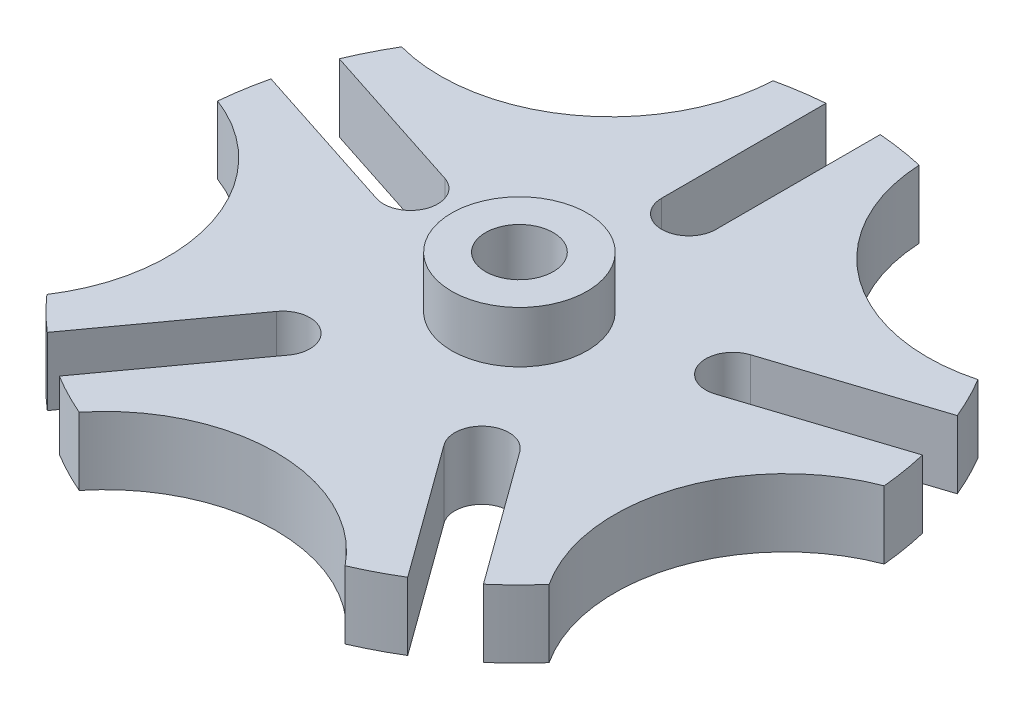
ISO-10303-21;
HEADER;
FILE_DESCRIPTION(('STEP AP214'),'2;1');
FILE_NAME('part.step','',(''),(''),'','','');
FILE_SCHEMA(('AUTOMOTIVE_DESIGN { 1 0 10303 214 1 1 1 1 }'));
ENDSEC;
DATA;
#1=APPLICATION_CONTEXT('core data for automotive mechanical design processes');
#2=APPLICATION_PROTOCOL_DEFINITION('international standard','automotive_design',2000,#1);
#3=PRODUCT_CONTEXT('',#1,'mechanical');
#4=PRODUCT('Part','Part','',(#3));
#5=PRODUCT_RELATED_PRODUCT_CATEGORY('part','',(#4));
#6=PRODUCT_DEFINITION_FORMATION('','',#4);
#7=PRODUCT_DEFINITION_CONTEXT('part definition',#1,'design');
#8=PRODUCT_DEFINITION('design','',#6,#7);
#9=PRODUCT_DEFINITION_SHAPE('','',#8);
#10=(LENGTH_UNIT() NAMED_UNIT(*) SI_UNIT(.MILLI.,.METRE.));
#11=(NAMED_UNIT(*) PLANE_ANGLE_UNIT() SI_UNIT($,.RADIAN.));
#12=(NAMED_UNIT(*) SI_UNIT($,.STERADIAN.) SOLID_ANGLE_UNIT());
#13=UNCERTAINTY_MEASURE_WITH_UNIT(LENGTH_MEASURE(1.E-05),#10,'distance_accuracy_value','');
#14=(GEOMETRIC_REPRESENTATION_CONTEXT(3) GLOBAL_UNCERTAINTY_ASSIGNED_CONTEXT((#13)) GLOBAL_UNIT_ASSIGNED_CONTEXT((#10,
#11,#12)) REPRESENTATION_CONTEXT('',''));
#15=CARTESIAN_POINT('',(0.,0.,0.));
#16=DIRECTION('',(0.,0.,1.));
#17=DIRECTION('',(1.,0.,0.));
#18=AXIS2_PLACEMENT_3D('',#15,#16,#17);
#19=CARTESIAN_POINT('',(0.,3.175,0.));
#20=DIRECTION('',(0.,1.,0.));
#21=DIRECTION('',(0.,0.,1.));
#22=AXIS2_PLACEMENT_3D('',#19,#20,#21);
#23=PLANE('',#22);
#24=CARTESIAN_POINT('',(-22.823101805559,3.175,-31.4133046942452));
#25=DIRECTION('',(0.,1.,0.));
#26=DIRECTION('',(0.95105651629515,0.,0.309016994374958));
#27=AXIS2_PLACEMENT_3D('',#24,#25,#26);
#28=CIRCLE('',#27,16.002);
#29=CARTESIAN_POINT('',(-27.0015845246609,3.175,-15.9664834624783));
#30=VERTEX_POINT('',#29);
#31=CARTESIAN_POINT('',(-6.84107964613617,3.175,-30.6139476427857));
#32=VERTEX_POINT('',#31);
#33=EDGE_CURVE('E229',#30,#32,#28,.T.);
#34=ORIENTED_EDGE('',*,*,#33,.F.);
#35=CARTESIAN_POINT('',(0.,3.175,0.));
#36=DIRECTION('',(0.,1.,0.));
#37=DIRECTION('',(0.,0.,1.));
#38=AXIS2_PLACEMENT_3D('',#35,#36,#37);
#39=CIRCLE('',#38,31.369);
#40=CARTESIAN_POINT('',(-28.9508269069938,3.175,-12.0774079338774));
#41=VERTEX_POINT('',#40);
#42=EDGE_CURVE('E41',#30,#41,#39,.T.);
#43=ORIENTED_EDGE('',*,*,#42,.T.);
#44=DIRECTION('',(-0.95105651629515,0.,-0.309016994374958));
#45=VECTOR('',#44,1.);
#46=CARTESIAN_POINT('',(-14.3131190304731,3.175,-7.32132833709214));
#47=LINE('',#46,#45);
#48=CARTESIAN_POINT('',(-14.3131190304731,3.175,-7.32132833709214));
#49=VERTEX_POINT('',#48);
#50=EDGE_CURVE('E356',#49,#41,#47,.T.);
#51=ORIENTED_EDGE('',*,*,#50,.F.);
#52=CARTESIAN_POINT('',(-15.0980221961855,3.175,-4.90564478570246));
#53=DIRECTION('',(0.,1.,0.));
#54=DIRECTION('',(-0.95105651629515,0.,-0.309016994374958));
#55=AXIS2_PLACEMENT_3D('',#52,#53,#54);
#56=CIRCLE('',#55,2.54);
#57=CARTESIAN_POINT('',(-15.8829253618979,3.175,-2.48996123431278));
#58=VERTEX_POINT('',#57);
#59=EDGE_CURVE('E368',#58,#49,#56,.T.);
#60=ORIENTED_EDGE('',*,*,#59,.F.);
#61=DIRECTION('',(0.95105651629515,0.,0.309016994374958));
#62=VECTOR('',#61,1.);
#63=CARTESIAN_POINT('',(-15.8829253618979,3.175,-2.48996123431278));
#64=LINE('',#63,#62);
#65=CARTESIAN_POINT('',(-30.5206332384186,3.175,-7.24604083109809));
#66=VERTEX_POINT('',#65);
#67=EDGE_CURVE('E375',#66,#58,#64,.T.);
#68=ORIENTED_EDGE('',*,*,#67,.F.);
#69=CARTESIAN_POINT('',(-31.2296042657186,3.175,-2.9539767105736));
#70=VERTEX_POINT('',#69);
#71=EDGE_CURVE('E282',#66,#70,#39,.T.);
#72=ORIENTED_EDGE('',*,*,#71,.T.);
#73=CARTESIAN_POINT('',(-36.9285544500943,3.175,11.9988146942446));
#74=DIRECTION('',(0.,1.,0.));
#75=DIRECTION('',(0.58778525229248,0.,-0.809016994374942));
#76=AXIS2_PLACEMENT_3D('',#73,#74,#75);
#77=CIRCLE('',#76,16.002);
#78=CARTESIAN_POINT('',(-23.5289766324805,3.175,20.7461181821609));
#79=VERTEX_POINT('',#78);
#80=EDGE_CURVE('E327',#79,#70,#77,.T.);
#81=ORIENTED_EDGE('',*,*,#80,.F.);
#82=CARTESIAN_POINT('',(-20.4325950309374,3.175,23.8017482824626));
#83=VERTEX_POINT('',#82);
#84=EDGE_CURVE('E514',#79,#83,#39,.T.);
#85=ORIENTED_EDGE('',*,*,#84,.T.);
#86=DIRECTION('',(-0.58778525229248,0.,0.809016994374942));
#87=VECTOR('',#86,1.);
#88=CARTESIAN_POINT('',(-11.3859940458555,3.175,11.3501702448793));
#89=LINE('',#88,#87);
#90=CARTESIAN_POINT('',(-11.3859940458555,3.175,11.3501702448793));
#91=VERTEX_POINT('',#90);
#92=EDGE_CURVE('E380',#91,#83,#89,.T.);
#93=ORIENTED_EDGE('',*,*,#92,.F.);
#94=CARTESIAN_POINT('',(-9.33109088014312,3.175,12.8431447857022));
#95=DIRECTION('',(0.,1.,0.));
#96=DIRECTION('',(-0.58778525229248,0.,0.809016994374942));
#97=AXIS2_PLACEMENT_3D('',#94,#95,#96);
#98=CIRCLE('',#97,2.54);
#99=CARTESIAN_POINT('',(-7.27618771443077,3.175,14.3361193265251));
#100=VERTEX_POINT('',#99);
#101=EDGE_CURVE('E390',#100,#91,#98,.T.);
#102=ORIENTED_EDGE('',*,*,#101,.F.);
#103=DIRECTION('',(0.58778525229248,0.,-0.809016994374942));
#104=VECTOR('',#103,1.);
#105=CARTESIAN_POINT('',(-7.27618771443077,3.175,14.3361193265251));
#106=LINE('',#105,#104);
#107=CARTESIAN_POINT('',(-16.3227886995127,3.175,26.7876973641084));
#108=VERTEX_POINT('',#107);
#109=EDGE_CURVE('E398',#108,#100,#106,.T.);
#110=ORIENTED_EDGE('',*,*,#109,.F.);
#111=CARTESIAN_POINT('',(-12.4598772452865,3.175,28.7882896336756));
#112=VERTEX_POINT('',#111);
#113=EDGE_CURVE('E519',#108,#112,#39,.T.);
#114=ORIENTED_EDGE('',*,*,#113,.T.);
#115=CARTESIAN_POINT('',(-2.84494650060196E-13,3.175,38.82898));
#116=DIRECTION('',(0.,1.,0.));
#117=DIRECTION('',(-0.587785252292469,0.,-0.809016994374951));
#118=AXIS2_PLACEMENT_3D('',#115,#116,#117);
#119=CIRCLE('',#118,16.002);
#120=CARTESIAN_POINT('',(12.459877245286,3.175,28.7882896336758));
#121=VERTEX_POINT('',#120);
#122=EDGE_CURVE('E325',#121,#112,#119,.T.);
#123=ORIENTED_EDGE('',*,*,#122,.F.);
#124=CARTESIAN_POINT('',(16.3227886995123,3.175,26.7876973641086));
#125=VERTEX_POINT('',#124);
#126=EDGE_CURVE('E520',#121,#125,#39,.T.);
#127=ORIENTED_EDGE('',*,*,#126,.T.);
#128=DIRECTION('',(0.587785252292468,0.,0.809016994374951));
#129=VECTOR('',#128,1.);
#130=CARTESIAN_POINT('',(7.27618771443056,3.175,14.3361193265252));
#131=LINE('',#130,#129);
#132=CARTESIAN_POINT('',(7.27618771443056,3.175,14.3361193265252));
#133=VERTEX_POINT('',#132);
#134=EDGE_CURVE('E406',#133,#125,#131,.T.);
#135=ORIENTED_EDGE('',*,*,#134,.F.);
#136=CARTESIAN_POINT('',(9.33109088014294,3.175,12.8431447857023));
#137=DIRECTION('',(0.,1.,0.));
#138=DIRECTION('',(0.587785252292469,0.,0.809016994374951));
#139=AXIS2_PLACEMENT_3D('',#136,#137,#138);
#140=CIRCLE('',#139,2.54);
#141=CARTESIAN_POINT('',(11.3859940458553,3.175,11.3501702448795));
#142=VERTEX_POINT('',#141);
#143=EDGE_CURVE('E417',#142,#133,#140,.T.);
#144=ORIENTED_EDGE('',*,*,#143,.F.);
#145=DIRECTION('',(-0.587785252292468,0.,-0.809016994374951));
#146=VECTOR('',#145,1.);
#147=CARTESIAN_POINT('',(11.3859940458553,3.175,11.3501702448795));
#148=LINE('',#147,#146);
#149=CARTESIAN_POINT('',(20.4325950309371,3.175,23.8017482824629));
#150=VERTEX_POINT('',#149);
#151=EDGE_CURVE('E425',#150,#142,#148,.T.);
#152=ORIENTED_EDGE('',*,*,#151,.F.);
#153=CARTESIAN_POINT('',(23.5289766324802,3.175,20.7461181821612));
#154=VERTEX_POINT('',#153);
#155=EDGE_CURVE('E522',#150,#154,#39,.T.);
#156=ORIENTED_EDGE('',*,*,#155,.T.);
#157=CARTESIAN_POINT('',(36.9285544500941,3.175,11.9988146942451));
#158=DIRECTION('',(0.,1.,0.));
#159=DIRECTION('',(-0.951056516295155,0.,0.309016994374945));
#160=AXIS2_PLACEMENT_3D('',#157,#158,#159);
#161=CIRCLE('',#160,16.002);
#162=CARTESIAN_POINT('',(31.2296042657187,3.175,-2.95397671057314));
#163=VERTEX_POINT('',#162);
#164=EDGE_CURVE('E339',#163,#154,#161,.T.);
#165=ORIENTED_EDGE('',*,*,#164,.F.);
#166=CARTESIAN_POINT('',(30.5206332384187,3.175,-7.24604083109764));
#167=VERTEX_POINT('',#166);
#168=EDGE_CURVE('E283',#163,#167,#39,.T.);
#169=ORIENTED_EDGE('',*,*,#168,.T.);
#170=DIRECTION('',(0.951056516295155,0.,-0.309016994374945));
#171=VECTOR('',#170,1.);
#172=CARTESIAN_POINT('',(15.8829253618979,3.175,-2.48996123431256));
#173=LINE('',#172,#171);
#174=CARTESIAN_POINT('',(15.8829253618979,3.175,-2.48996123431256));
#175=VERTEX_POINT('',#174);
#176=EDGE_CURVE('E433',#175,#167,#173,.T.);
#177=ORIENTED_EDGE('',*,*,#176,.F.);
#178=CARTESIAN_POINT('',(15.0980221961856,3.175,-4.90564478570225));
#179=DIRECTION('',(0.,1.,0.));
#180=DIRECTION('',(0.951056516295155,0.,-0.309016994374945));
#181=AXIS2_PLACEMENT_3D('',#178,#179,#180);
#182=CIRCLE('',#181,2.54);
#183=CARTESIAN_POINT('',(14.3131190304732,3.175,-7.32132833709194));
#184=VERTEX_POINT('',#183);
#185=EDGE_CURVE('E444',#184,#175,#182,.T.);
#186=ORIENTED_EDGE('',*,*,#185,.F.);
#187=DIRECTION('',(-0.951056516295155,0.,0.309016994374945));
#188=VECTOR('',#187,1.);
#189=CARTESIAN_POINT('',(14.3131190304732,3.175,-7.32132833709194));
#190=LINE('',#189,#188);
#191=CARTESIAN_POINT('',(28.9508269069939,3.175,-12.077407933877));
#192=VERTEX_POINT('',#191);
#193=EDGE_CURVE('E452',#192,#184,#190,.T.);
#194=ORIENTED_EDGE('',*,*,#193,.F.);
#195=CARTESIAN_POINT('',(27.0015845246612,3.175,-15.9664834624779));
#196=VERTEX_POINT('',#195);
#197=EDGE_CURVE('E42',#192,#196,#39,.T.);
#198=ORIENTED_EDGE('',*,*,#197,.T.);
#199=CARTESIAN_POINT('',(22.8231018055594,3.175,-31.4133046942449));
#200=DIRECTION('',(0.,1.,0.));
#201=DIRECTION('',(0.,0.,1.));
#202=AXIS2_PLACEMENT_3D('',#199,#200,#201);
#203=CIRCLE('',#202,16.002);
#204=CARTESIAN_POINT('',(6.84107964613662,3.175,-30.6139476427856));
#205=VERTEX_POINT('',#204);
#206=EDGE_CURVE('E348',#205,#196,#203,.T.);
#207=ORIENTED_EDGE('',*,*,#206,.F.);
#208=CARTESIAN_POINT('',(2.54,3.175,-31.2659968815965));
#209=VERTEX_POINT('',#208);
#210=EDGE_CURVE('E279',#205,#209,#39,.T.);
#211=ORIENTED_EDGE('',*,*,#210,.T.);
#212=DIRECTION('',(0.,0.,-1.));
#213=VECTOR('',#212,1.);
#214=CARTESIAN_POINT('',(2.54,3.175,-15.875));
#215=LINE('',#214,#213);
#216=CARTESIAN_POINT('',(2.54,3.175,-15.875));
#217=VERTEX_POINT('',#216);
#218=EDGE_CURVE('E256',#217,#209,#215,.T.);
#219=ORIENTED_EDGE('',*,*,#218,.F.);
#220=CARTESIAN_POINT('',(0.,3.175,-15.875));
#221=DIRECTION('',(0.,1.,0.));
#222=DIRECTION('',(0.,0.,-1.));
#223=AXIS2_PLACEMENT_3D('',#220,#221,#222);
#224=CIRCLE('',#223,2.54);
#225=CARTESIAN_POINT('',(-2.54,3.175,-15.875));
#226=VERTEX_POINT('',#225);
#227=EDGE_CURVE('E253',#226,#217,#224,.T.);
#228=ORIENTED_EDGE('',*,*,#227,.F.);
#229=DIRECTION('',(0.,0.,1.));
#230=VECTOR('',#229,1.);
#231=CARTESIAN_POINT('',(-2.54,3.175,-15.875));
#232=LINE('',#231,#230);
#233=CARTESIAN_POINT('',(-2.53999999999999,3.175,-31.2659968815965));
#234=VERTEX_POINT('',#233);
#235=EDGE_CURVE('E250',#234,#226,#232,.T.);
#236=ORIENTED_EDGE('',*,*,#235,.F.);
#237=EDGE_CURVE('E11',#234,#32,#39,.T.);
#238=ORIENTED_EDGE('',*,*,#237,.T.);
#239=EDGE_LOOP('',(#34,#43,#51,#60,#68,#72,#81,#85,#93,#102,#110,#114,#123,#127,#135,#144,#152,
#156,#165,#169,#177,#186,#194,#198,#207,#211,#219,#228,#236,#238));
#240=FACE_BOUND('',#239,.T.);
#241=CARTESIAN_POINT('',(0.,3.175,0.));
#242=DIRECTION('',(0.,1.,0.));
#243=DIRECTION('',(0.,0.,1.));
#244=AXIS2_PLACEMENT_3D('',#241,#242,#243);
#245=CIRCLE('',#244,6.35);
#246=CARTESIAN_POINT('',(0.,3.175,6.35));
#247=VERTEX_POINT('',#246);
#248=EDGE_CURVE('E502',#247,#247,#245,.T.);
#249=ORIENTED_EDGE('',*,*,#248,.F.);
#250=EDGE_LOOP('',(#249));
#251=FACE_BOUND('',#250,.T.);
#252=ADVANCED_FACE('F33',(#240,#251),#23,.T.);
#253=CARTESIAN_POINT('',(0.,3.175,0.));
#254=DIRECTION('',(0.,-1.,0.));
#255=DIRECTION('',(0.,0.,-1.));
#256=AXIS2_PLACEMENT_3D('',#253,#254,#255);
#257=CYLINDRICAL_SURFACE('',#256,31.369);
#258=CARTESIAN_POINT('',(0.,-3.175,0.));
#259=DIRECTION('',(0.,1.,0.));
#260=DIRECTION('',(0.,0.,1.));
#261=AXIS2_PLACEMENT_3D('',#258,#259,#260);
#262=CIRCLE('',#261,31.369);
#263=CARTESIAN_POINT('',(-2.53999999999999,-3.175,-31.2659968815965));
#264=VERTEX_POINT('',#263);
#265=CARTESIAN_POINT('',(-6.84107964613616,-3.175,-30.6139476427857));
#266=VERTEX_POINT('',#265);
#267=EDGE_CURVE('E243',#264,#266,#262,.T.);
#268=ORIENTED_EDGE('',*,*,#267,.T.);
#269=DIRECTION('',(0.,1.,0.));
#270=VECTOR('',#269,1.);
#271=CARTESIAN_POINT('',(-6.84107964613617,-3.175,-30.6139476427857));
#272=LINE('',#271,#270);
#273=EDGE_CURVE('E49',#266,#32,#272,.T.);
#274=ORIENTED_EDGE('',*,*,#273,.T.);
#275=ORIENTED_EDGE('',*,*,#237,.F.);
#276=DIRECTION('',(0.,1.,0.));
#277=VECTOR('',#276,1.);
#278=CARTESIAN_POINT('',(-2.53999999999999,-3.175,-31.2659968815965));
#279=LINE('',#278,#277);
#280=EDGE_CURVE('E274',#264,#234,#279,.T.);
#281=ORIENTED_EDGE('',*,*,#280,.F.);
#282=EDGE_LOOP('',(#268,#274,#275,#281));
#283=FACE_BOUND('',#282,.T.);
#284=ADVANCED_FACE('F240',(#283),#257,.T.);
#285=CARTESIAN_POINT('',(-30.5206332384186,-3.175,-7.24604083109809));
#286=VERTEX_POINT('',#285);
#287=CARTESIAN_POINT('',(-31.2296042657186,-3.175,-2.9539767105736));
#288=VERTEX_POINT('',#287);
#289=EDGE_CURVE('E284',#286,#288,#262,.T.);
#290=ORIENTED_EDGE('',*,*,#289,.T.);
#291=DIRECTION('',(0.,1.,0.));
#292=VECTOR('',#291,1.);
#293=CARTESIAN_POINT('',(-31.2296042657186,-3.175,-2.9539767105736));
#294=LINE('',#293,#292);
#295=EDGE_CURVE('E57',#288,#70,#294,.T.);
#296=ORIENTED_EDGE('',*,*,#295,.T.);
#297=ORIENTED_EDGE('',*,*,#71,.F.);
#298=DIRECTION('',(0.,1.,0.));
#299=VECTOR('',#298,1.);
#300=CARTESIAN_POINT('',(-30.5206332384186,-3.175,-7.24604083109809));
#301=LINE('',#300,#299);
#302=EDGE_CURVE('E312',#286,#66,#301,.T.);
#303=ORIENTED_EDGE('',*,*,#302,.F.);
#304=EDGE_LOOP('',(#290,#296,#297,#303));
#305=FACE_BOUND('',#304,.T.);
#306=ADVANCED_FACE('F309',(#305),#257,.T.);
#307=CARTESIAN_POINT('',(-16.3227886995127,-3.175,26.7876973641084));
#308=VERTEX_POINT('',#307);
#309=CARTESIAN_POINT('',(-12.4598772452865,-3.175,28.7882896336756));
#310=VERTEX_POINT('',#309);
#311=EDGE_CURVE('E295',#308,#310,#262,.T.);
#312=ORIENTED_EDGE('',*,*,#311,.T.);
#313=DIRECTION('',(0.,1.,0.));
#314=VECTOR('',#313,1.);
#315=CARTESIAN_POINT('',(-12.4598772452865,-3.175,28.7882896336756));
#316=LINE('',#315,#314);
#317=EDGE_CURVE('E332',#310,#112,#316,.T.);
#318=ORIENTED_EDGE('',*,*,#317,.T.);
#319=ORIENTED_EDGE('',*,*,#113,.F.);
#320=DIRECTION('',(0.,1.,0.));
#321=VECTOR('',#320,1.);
#322=CARTESIAN_POINT('',(-16.3227886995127,-3.175,26.7876973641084));
#323=LINE('',#322,#321);
#324=EDGE_CURVE('E404',#308,#108,#323,.T.);
#325=ORIENTED_EDGE('',*,*,#324,.F.);
#326=EDGE_LOOP('',(#312,#318,#319,#325));
#327=FACE_BOUND('',#326,.T.);
#328=ADVANCED_FACE('F655',(#327),#257,.T.);
#329=CARTESIAN_POINT('',(20.4325950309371,-3.175,23.8017482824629));
#330=VERTEX_POINT('',#329);
#331=CARTESIAN_POINT('',(23.5289766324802,-3.175,20.7461181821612));
#332=VERTEX_POINT('',#331);
#333=EDGE_CURVE('E288',#330,#332,#262,.T.);
#334=ORIENTED_EDGE('',*,*,#333,.T.);
#335=DIRECTION('',(0.,1.,0.));
#336=VECTOR('',#335,1.);
#337=CARTESIAN_POINT('',(23.5289766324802,-3.175,20.7461181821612));
#338=LINE('',#337,#336);
#339=EDGE_CURVE('E341',#332,#154,#338,.T.);
#340=ORIENTED_EDGE('',*,*,#339,.T.);
#341=ORIENTED_EDGE('',*,*,#155,.F.);
#342=DIRECTION('',(0.,1.,0.));
#343=VECTOR('',#342,1.);
#344=CARTESIAN_POINT('',(20.4325950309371,-3.175,23.8017482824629));
#345=LINE('',#344,#343);
#346=EDGE_CURVE('E431',#330,#150,#345,.T.);
#347=ORIENTED_EDGE('',*,*,#346,.F.);
#348=EDGE_LOOP('',(#334,#340,#341,#347));
#349=FACE_BOUND('',#348,.T.);
#350=ADVANCED_FACE('F650',(#349),#257,.T.);
#351=CARTESIAN_POINT('',(28.9508269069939,-3.175,-12.077407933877));
#352=VERTEX_POINT('',#351);
#353=CARTESIAN_POINT('',(27.0015845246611,-3.175,-15.9664834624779));
#354=VERTEX_POINT('',#353);
#355=EDGE_CURVE('E281',#352,#354,#262,.T.);
#356=ORIENTED_EDGE('',*,*,#355,.T.);
#357=DIRECTION('',(0.,1.,0.));
#358=VECTOR('',#357,1.);
#359=CARTESIAN_POINT('',(27.0015845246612,-3.175,-15.9664834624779));
#360=LINE('',#359,#358);
#361=EDGE_CURVE('E354',#354,#196,#360,.T.);
#362=ORIENTED_EDGE('',*,*,#361,.T.);
#363=ORIENTED_EDGE('',*,*,#197,.F.);
#364=DIRECTION('',(0.,1.,0.));
#365=VECTOR('',#364,1.);
#366=CARTESIAN_POINT('',(28.9508269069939,-3.175,-12.077407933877));
#367=LINE('',#366,#365);
#368=EDGE_CURVE('E458',#352,#192,#367,.T.);
#369=ORIENTED_EDGE('',*,*,#368,.F.);
#370=EDGE_LOOP('',(#356,#362,#363,#369));
#371=FACE_BOUND('',#370,.T.);
#372=ADVANCED_FACE('F644',(#371),#257,.T.);
#373=ORIENTED_EDGE('',*,*,#84,.F.);
#374=DIRECTION('',(0.,1.,0.));
#375=VECTOR('',#374,1.);
#376=CARTESIAN_POINT('',(-23.5289766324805,-3.175,20.7461181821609));
#377=LINE('',#376,#375);
#378=CARTESIAN_POINT('',(-23.5289766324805,-3.175,20.7461181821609));
#379=VERTEX_POINT('',#378);
#380=EDGE_CURVE('E323',#379,#79,#377,.T.);
#381=ORIENTED_EDGE('',*,*,#380,.F.);
#382=CARTESIAN_POINT('',(-20.4325950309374,-3.175,23.8017482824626));
#383=VERTEX_POINT('',#382);
#384=EDGE_CURVE('E285',#379,#383,#262,.T.);
#385=ORIENTED_EDGE('',*,*,#384,.T.);
#386=DIRECTION('',(0.,1.,0.));
#387=VECTOR('',#386,1.);
#388=CARTESIAN_POINT('',(-20.4325950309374,-3.175,23.8017482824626));
#389=LINE('',#388,#387);
#390=EDGE_CURVE('E383',#383,#83,#389,.T.);
#391=ORIENTED_EDGE('',*,*,#390,.T.);
#392=EDGE_LOOP('',(#373,#381,#385,#391));
#393=FACE_BOUND('',#392,.T.);
#394=ADVANCED_FACE('F517',(#393),#257,.T.);
#395=ORIENTED_EDGE('',*,*,#126,.F.);
#396=DIRECTION('',(0.,1.,0.));
#397=VECTOR('',#396,1.);
#398=CARTESIAN_POINT('',(12.459877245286,-3.175,28.7882896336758));
#399=LINE('',#398,#397);
#400=CARTESIAN_POINT('',(12.459877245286,-3.175,28.7882896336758));
#401=VERTEX_POINT('',#400);
#402=EDGE_CURVE('E337',#401,#121,#399,.T.);
#403=ORIENTED_EDGE('',*,*,#402,.F.);
#404=CARTESIAN_POINT('',(16.3227886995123,-3.175,26.7876973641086));
#405=VERTEX_POINT('',#404);
#406=EDGE_CURVE('E293',#401,#405,#262,.T.);
#407=ORIENTED_EDGE('',*,*,#406,.T.);
#408=DIRECTION('',(0.,1.,0.));
#409=VECTOR('',#408,1.);
#410=CARTESIAN_POINT('',(16.3227886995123,-3.175,26.7876973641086));
#411=LINE('',#410,#409);
#412=EDGE_CURVE('E409',#405,#125,#411,.T.);
#413=ORIENTED_EDGE('',*,*,#412,.T.);
#414=EDGE_LOOP('',(#395,#403,#407,#413));
#415=FACE_BOUND('',#414,.T.);
#416=ADVANCED_FACE('F626',(#415),#257,.T.);
#417=ORIENTED_EDGE('',*,*,#168,.F.);
#418=DIRECTION('',(0.,1.,0.));
#419=VECTOR('',#418,1.);
#420=CARTESIAN_POINT('',(31.2296042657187,-3.175,-2.95397671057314));
#421=LINE('',#420,#419);
#422=CARTESIAN_POINT('',(31.2296042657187,-3.175,-2.95397671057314));
#423=VERTEX_POINT('',#422);
#424=EDGE_CURVE('E346',#423,#163,#421,.T.);
#425=ORIENTED_EDGE('',*,*,#424,.F.);
#426=CARTESIAN_POINT('',(30.5206332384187,-3.175,-7.24604083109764));
#427=VERTEX_POINT('',#426);
#428=EDGE_CURVE('E287',#423,#427,#262,.T.);
#429=ORIENTED_EDGE('',*,*,#428,.T.);
#430=DIRECTION('',(0.,1.,0.));
#431=VECTOR('',#430,1.);
#432=CARTESIAN_POINT('',(30.5206332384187,-3.175,-7.24604083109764));
#433=LINE('',#432,#431);
#434=EDGE_CURVE('E436',#427,#167,#433,.T.);
#435=ORIENTED_EDGE('',*,*,#434,.T.);
#436=EDGE_LOOP('',(#417,#425,#429,#435));
#437=FACE_BOUND('',#436,.T.);
#438=ADVANCED_FACE('F621',(#437),#257,.T.);
#439=ORIENTED_EDGE('',*,*,#210,.F.);
#440=DIRECTION('',(0.,1.,0.));
#441=VECTOR('',#440,1.);
#442=CARTESIAN_POINT('',(6.84107964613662,-3.175,-30.6139476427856));
#443=LINE('',#442,#441);
#444=CARTESIAN_POINT('',(6.84107964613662,-3.175,-30.6139476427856));
#445=VERTEX_POINT('',#444);
#446=EDGE_CURVE('E353',#445,#205,#443,.T.);
#447=ORIENTED_EDGE('',*,*,#446,.F.);
#448=CARTESIAN_POINT('',(2.54,-3.175,-31.2659968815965));
#449=VERTEX_POINT('',#448);
#450=EDGE_CURVE('E273',#445,#449,#262,.T.);
#451=ORIENTED_EDGE('',*,*,#450,.T.);
#452=DIRECTION('',(0.,1.,0.));
#453=VECTOR('',#452,1.);
#454=CARTESIAN_POINT('',(2.54,-3.175,-31.2659968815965));
#455=LINE('',#454,#453);
#456=EDGE_CURVE('E276',#449,#209,#455,.T.);
#457=ORIENTED_EDGE('',*,*,#456,.T.);
#458=EDGE_LOOP('',(#439,#447,#451,#457));
#459=FACE_BOUND('',#458,.T.);
#460=ADVANCED_FACE('F469',(#459),#257,.T.);
#461=ORIENTED_EDGE('',*,*,#42,.F.);
#462=DIRECTION('',(0.,1.,0.));
#463=VECTOR('',#462,1.);
#464=CARTESIAN_POINT('',(-27.0015845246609,-3.175,-15.9664834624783));
#465=LINE('',#464,#463);
#466=CARTESIAN_POINT('',(-27.0015845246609,-3.175,-15.9664834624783));
#467=VERTEX_POINT('',#466);
#468=EDGE_CURVE('E232',#467,#30,#465,.T.);
#469=ORIENTED_EDGE('',*,*,#468,.F.);
#470=CARTESIAN_POINT('',(-28.9508269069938,-3.175,-12.0774079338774));
#471=VERTEX_POINT('',#470);
#472=EDGE_CURVE('E280',#467,#471,#262,.T.);
#473=ORIENTED_EDGE('',*,*,#472,.T.);
#474=DIRECTION('',(0.,1.,0.));
#475=VECTOR('',#474,1.);
#476=CARTESIAN_POINT('',(-28.9508269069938,-3.175,-12.0774079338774));
#477=LINE('',#476,#475);
#478=EDGE_CURVE('E360',#471,#41,#477,.T.);
#479=ORIENTED_EDGE('',*,*,#478,.T.);
#480=EDGE_LOOP('',(#461,#469,#473,#479));
#481=FACE_BOUND('',#480,.T.);
#482=ADVANCED_FACE('F35',(#481),#257,.T.);
#483=CARTESIAN_POINT('',(0.,-3.175,0.));
#484=DIRECTION('',(0.,1.,0.));
#485=DIRECTION('',(0.,0.,1.));
#486=AXIS2_PLACEMENT_3D('',#483,#484,#485);
#487=PLANE('',#486);
#488=CARTESIAN_POINT('',(0.,-3.175,0.));
#489=DIRECTION('',(0.,1.,0.));
#490=DIRECTION('',(0.,0.,1.));
#491=AXIS2_PLACEMENT_3D('',#488,#489,#490);
#492=CIRCLE('',#491,3.175);
#493=CARTESIAN_POINT('',(0.,-3.175,3.175));
#494=VERTEX_POINT('',#493);
#495=EDGE_CURVE('E497',#494,#494,#492,.T.);
#496=ORIENTED_EDGE('',*,*,#495,.T.);
#497=EDGE_LOOP('',(#496));
#498=FACE_BOUND('',#497,.T.);
#499=ORIENTED_EDGE('',*,*,#472,.F.);
#500=CARTESIAN_POINT('',(-22.823101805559,-3.175,-31.4133046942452));
#501=DIRECTION('',(0.,1.,0.));
#502=DIRECTION('',(0.95105651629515,0.,0.309016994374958));
#503=AXIS2_PLACEMENT_3D('',#500,#501,#502);
#504=CIRCLE('',#503,16.002);
#505=EDGE_CURVE('E244',#467,#266,#504,.T.);
#506=ORIENTED_EDGE('',*,*,#505,.T.);
#507=ORIENTED_EDGE('',*,*,#267,.F.);
#508=DIRECTION('',(0.,0.,1.));
#509=VECTOR('',#508,1.);
#510=CARTESIAN_POINT('',(-2.54,-3.175,-15.875));
#511=LINE('',#510,#509);
#512=CARTESIAN_POINT('',(-2.54,-3.175,-15.875));
#513=VERTEX_POINT('',#512);
#514=EDGE_CURVE('E267',#264,#513,#511,.T.);
#515=ORIENTED_EDGE('',*,*,#514,.T.);
#516=CARTESIAN_POINT('',(0.,-3.175,-15.875));
#517=DIRECTION('',(0.,1.,0.));
#518=DIRECTION('',(0.,0.,-1.));
#519=AXIS2_PLACEMENT_3D('',#516,#517,#518);
#520=CIRCLE('',#519,2.54);
#521=CARTESIAN_POINT('',(2.54,-3.175,-15.875));
#522=VERTEX_POINT('',#521);
#523=EDGE_CURVE('E255',#513,#522,#520,.T.);
#524=ORIENTED_EDGE('',*,*,#523,.T.);
#525=DIRECTION('',(0.,0.,-1.));
#526=VECTOR('',#525,1.);
#527=CARTESIAN_POINT('',(2.54,-3.175,-15.875));
#528=LINE('',#527,#526);
#529=EDGE_CURVE('E259',#522,#449,#528,.T.);
#530=ORIENTED_EDGE('',*,*,#529,.T.);
#531=ORIENTED_EDGE('',*,*,#450,.F.);
#532=CARTESIAN_POINT('',(22.8231018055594,-3.175,-31.4133046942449));
#533=DIRECTION('',(0.,1.,0.));
#534=DIRECTION('',(0.,0.,1.));
#535=AXIS2_PLACEMENT_3D('',#532,#533,#534);
#536=CIRCLE('',#535,16.002);
#537=EDGE_CURVE('E350',#445,#354,#536,.T.);
#538=ORIENTED_EDGE('',*,*,#537,.T.);
#539=ORIENTED_EDGE('',*,*,#355,.F.);
#540=DIRECTION('',(-0.951056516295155,0.,0.309016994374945));
#541=VECTOR('',#540,1.);
#542=CARTESIAN_POINT('',(14.3131190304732,-3.175,-7.32132833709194));
#543=LINE('',#542,#541);
#544=CARTESIAN_POINT('',(14.3131190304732,-3.175,-7.32132833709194));
#545=VERTEX_POINT('',#544);
#546=EDGE_CURVE('E455',#352,#545,#543,.T.);
#547=ORIENTED_EDGE('',*,*,#546,.T.);
#548=CARTESIAN_POINT('',(15.0980221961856,-3.175,-4.90564478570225));
#549=DIRECTION('',(0.,1.,0.));
#550=DIRECTION('',(0.951056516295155,0.,-0.309016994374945));
#551=AXIS2_PLACEMENT_3D('',#548,#549,#550);
#552=CIRCLE('',#551,2.54);
#553=CARTESIAN_POINT('',(15.8829253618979,-3.175,-2.48996123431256));
#554=VERTEX_POINT('',#553);
#555=EDGE_CURVE('E447',#545,#554,#552,.T.);
#556=ORIENTED_EDGE('',*,*,#555,.T.);
#557=DIRECTION('',(0.951056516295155,0.,-0.309016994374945));
#558=VECTOR('',#557,1.);
#559=CARTESIAN_POINT('',(15.8829253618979,-3.175,-2.48996123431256));
#560=LINE('',#559,#558);
#561=EDGE_CURVE('E439',#554,#427,#560,.T.);
#562=ORIENTED_EDGE('',*,*,#561,.T.);
#563=ORIENTED_EDGE('',*,*,#428,.F.);
#564=CARTESIAN_POINT('',(36.9285544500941,-3.175,11.9988146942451));
#565=DIRECTION('',(0.,1.,0.));
#566=DIRECTION('',(-0.951056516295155,0.,0.309016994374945));
#567=AXIS2_PLACEMENT_3D('',#564,#565,#566);
#568=CIRCLE('',#567,16.002);
#569=EDGE_CURVE('E343',#423,#332,#568,.T.);
#570=ORIENTED_EDGE('',*,*,#569,.T.);
#571=ORIENTED_EDGE('',*,*,#333,.F.);
#572=DIRECTION('',(-0.587785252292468,0.,-0.809016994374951));
#573=VECTOR('',#572,1.);
#574=CARTESIAN_POINT('',(11.3859940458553,-3.175,11.3501702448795));
#575=LINE('',#574,#573);
#576=CARTESIAN_POINT('',(11.3859940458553,-3.175,11.3501702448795));
#577=VERTEX_POINT('',#576);
#578=EDGE_CURVE('E428',#330,#577,#575,.T.);
#579=ORIENTED_EDGE('',*,*,#578,.T.);
#580=CARTESIAN_POINT('',(9.33109088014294,-3.175,12.8431447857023));
#581=DIRECTION('',(0.,1.,0.));
#582=DIRECTION('',(0.587785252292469,0.,0.809016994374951));
#583=AXIS2_PLACEMENT_3D('',#580,#581,#582);
#584=CIRCLE('',#583,2.54);
#585=CARTESIAN_POINT('',(7.27618771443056,-3.175,14.3361193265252));
#586=VERTEX_POINT('',#585);
#587=EDGE_CURVE('E420',#577,#586,#584,.T.);
#588=ORIENTED_EDGE('',*,*,#587,.T.);
#589=DIRECTION('',(0.587785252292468,0.,0.809016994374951));
#590=VECTOR('',#589,1.);
#591=CARTESIAN_POINT('',(7.27618771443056,-3.175,14.3361193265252));
#592=LINE('',#591,#590);
#593=EDGE_CURVE('E412',#586,#405,#592,.T.);
#594=ORIENTED_EDGE('',*,*,#593,.T.);
#595=ORIENTED_EDGE('',*,*,#406,.F.);
#596=CARTESIAN_POINT('',(-2.84494650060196E-13,-3.175,38.82898));
#597=DIRECTION('',(0.,1.,0.));
#598=DIRECTION('',(-0.587785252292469,0.,-0.809016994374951));
#599=AXIS2_PLACEMENT_3D('',#596,#597,#598);
#600=CIRCLE('',#599,16.002);
#601=EDGE_CURVE('E334',#401,#310,#600,.T.);
#602=ORIENTED_EDGE('',*,*,#601,.T.);
#603=ORIENTED_EDGE('',*,*,#311,.F.);
#604=DIRECTION('',(0.58778525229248,0.,-0.809016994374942));
#605=VECTOR('',#604,1.);
#606=CARTESIAN_POINT('',(-7.27618771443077,-3.175,14.3361193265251));
#607=LINE('',#606,#605);
#608=CARTESIAN_POINT('',(-7.27618771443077,-3.175,14.3361193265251));
#609=VERTEX_POINT('',#608);
#610=EDGE_CURVE('E401',#308,#609,#607,.T.);
#611=ORIENTED_EDGE('',*,*,#610,.T.);
#612=CARTESIAN_POINT('',(-9.33109088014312,-3.175,12.8431447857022));
#613=DIRECTION('',(0.,1.,0.));
#614=DIRECTION('',(-0.58778525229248,0.,0.809016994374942));
#615=AXIS2_PLACEMENT_3D('',#612,#613,#614);
#616=CIRCLE('',#615,2.54);
#617=CARTESIAN_POINT('',(-11.3859940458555,-3.175,11.3501702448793));
#618=VERTEX_POINT('',#617);
#619=EDGE_CURVE('E393',#609,#618,#616,.T.);
#620=ORIENTED_EDGE('',*,*,#619,.T.);
#621=DIRECTION('',(-0.58778525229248,0.,0.809016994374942));
#622=VECTOR('',#621,1.);
#623=CARTESIAN_POINT('',(-11.3859940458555,-3.175,11.3501702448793));
#624=LINE('',#623,#622);
#625=EDGE_CURVE('E386',#618,#383,#624,.T.);
#626=ORIENTED_EDGE('',*,*,#625,.T.);
#627=ORIENTED_EDGE('',*,*,#384,.F.);
#628=CARTESIAN_POINT('',(-36.9285544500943,-3.175,11.9988146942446));
#629=DIRECTION('',(0.,1.,0.));
#630=DIRECTION('',(0.58778525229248,0.,-0.809016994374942));
#631=AXIS2_PLACEMENT_3D('',#628,#629,#630);
#632=CIRCLE('',#631,16.002);
#633=EDGE_CURVE('E320',#379,#288,#632,.T.);
#634=ORIENTED_EDGE('',*,*,#633,.T.);
#635=ORIENTED_EDGE('',*,*,#289,.F.);
#636=DIRECTION('',(0.95105651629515,0.,0.309016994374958));
#637=VECTOR('',#636,1.);
#638=CARTESIAN_POINT('',(-15.8829253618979,-3.175,-2.48996123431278));
#639=LINE('',#638,#637);
#640=CARTESIAN_POINT('',(-15.8829253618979,-3.175,-2.48996123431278));
#641=VERTEX_POINT('',#640);
#642=EDGE_CURVE('E318',#286,#641,#639,.T.);
#643=ORIENTED_EDGE('',*,*,#642,.T.);
#644=CARTESIAN_POINT('',(-15.0980221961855,-3.175,-4.90564478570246));
#645=DIRECTION('',(0.,1.,0.));
#646=DIRECTION('',(-0.95105651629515,0.,-0.309016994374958));
#647=AXIS2_PLACEMENT_3D('',#644,#645,#646);
#648=CIRCLE('',#647,2.54);
#649=CARTESIAN_POINT('',(-14.3131190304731,-3.175,-7.32132833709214));
#650=VERTEX_POINT('',#649);
#651=EDGE_CURVE('E371',#641,#650,#648,.T.);
#652=ORIENTED_EDGE('',*,*,#651,.T.);
#653=DIRECTION('',(-0.95105651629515,0.,-0.309016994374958));
#654=VECTOR('',#653,1.);
#655=CARTESIAN_POINT('',(-14.3131190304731,-3.175,-7.32132833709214));
#656=LINE('',#655,#654);
#657=EDGE_CURVE('E363',#650,#471,#656,.T.);
#658=ORIENTED_EDGE('',*,*,#657,.T.);
#659=EDGE_LOOP('',(#499,#506,#507,#515,#524,#530,#531,#538,#539,#547,#556,#562,#563,#570,#571,
#579,#588,#594,#595,#602,#603,#611,#620,#626,#627,#634,#635,#643,#652,#658));
#660=FACE_BOUND('',#659,.T.);
#661=ADVANCED_FACE('F316',(#498,#660),#487,.F.);
#662=CARTESIAN_POINT('',(0.,-3.175,-15.875));
#663=DIRECTION('',(0.,1.,0.));
#664=DIRECTION('',(0.,0.,1.));
#665=AXIS2_PLACEMENT_3D('',#662,#663,#664);
#666=CYLINDRICAL_SURFACE('',#665,2.54);
#667=ORIENTED_EDGE('',*,*,#227,.T.);
#668=DIRECTION('',(0.,1.,0.));
#669=VECTOR('',#668,1.);
#670=CARTESIAN_POINT('',(2.54,-3.175,-15.875));
#671=LINE('',#670,#669);
#672=EDGE_CURVE('E270',#522,#217,#671,.T.);
#673=ORIENTED_EDGE('',*,*,#672,.F.);
#674=ORIENTED_EDGE('',*,*,#523,.F.);
#675=DIRECTION('',(0.,1.,0.));
#676=VECTOR('',#675,1.);
#677=CARTESIAN_POINT('',(-2.54,-3.175,-15.875));
#678=LINE('',#677,#676);
#679=EDGE_CURVE('E271',#513,#226,#678,.T.);
#680=ORIENTED_EDGE('',*,*,#679,.T.);
#681=EDGE_LOOP('',(#667,#673,#674,#680));
#682=FACE_BOUND('',#681,.T.);
#683=ADVANCED_FACE('F460',(#682),#666,.F.);
#684=CARTESIAN_POINT('',(-2.54,-3.175,-15.875));
#685=DIRECTION('',(-1.,0.,0.));
#686=DIRECTION('',(0.,0.,1.));
#687=AXIS2_PLACEMENT_3D('',#684,#685,#686);
#688=PLANE('',#687);
#689=ORIENTED_EDGE('',*,*,#235,.T.);
#690=ORIENTED_EDGE('',*,*,#679,.F.);
#691=ORIENTED_EDGE('',*,*,#514,.F.);
#692=ORIENTED_EDGE('',*,*,#280,.T.);
#693=EDGE_LOOP('',(#689,#690,#691,#692));
#694=FACE_BOUND('',#693,.T.);
#695=ADVANCED_FACE('F472',(#694),#688,.F.);
#696=CARTESIAN_POINT('',(2.54,-3.175,-15.875));
#697=DIRECTION('',(1.,0.,0.));
#698=DIRECTION('',(0.,0.,-1.));
#699=AXIS2_PLACEMENT_3D('',#696,#697,#698);
#700=PLANE('',#699);
#701=ORIENTED_EDGE('',*,*,#218,.T.);
#702=ORIENTED_EDGE('',*,*,#456,.F.);
#703=ORIENTED_EDGE('',*,*,#529,.F.);
#704=ORIENTED_EDGE('',*,*,#672,.T.);
#705=EDGE_LOOP('',(#701,#702,#703,#704));
#706=FACE_BOUND('',#705,.T.);
#707=ADVANCED_FACE('F467',(#706),#700,.F.);
#708=CARTESIAN_POINT('',(14.3131190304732,-3.175,-7.32132833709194));
#709=DIRECTION('',(-0.309016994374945,0.,-0.951056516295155));
#710=DIRECTION('',(-0.951056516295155,0.,0.309016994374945));
#711=AXIS2_PLACEMENT_3D('',#708,#709,#710);
#712=PLANE('',#711);
#713=ORIENTED_EDGE('',*,*,#193,.T.);
#714=DIRECTION('',(0.,1.,0.));
#715=VECTOR('',#714,1.);
#716=CARTESIAN_POINT('',(14.3131190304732,-3.175,-7.32132833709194));
#717=LINE('',#716,#715);
#718=EDGE_CURVE('E450',#545,#184,#717,.T.);
#719=ORIENTED_EDGE('',*,*,#718,.F.);
#720=ORIENTED_EDGE('',*,*,#546,.F.);
#721=ORIENTED_EDGE('',*,*,#368,.T.);
#722=EDGE_LOOP('',(#713,#719,#720,#721));
#723=FACE_BOUND('',#722,.T.);
#724=ADVANCED_FACE('F479',(#723),#712,.F.);
#725=CARTESIAN_POINT('',(15.0980221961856,-3.175,-4.90564478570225));
#726=DIRECTION('',(0.,1.,0.));
#727=DIRECTION('',(-0.951056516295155,0.,0.309016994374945));
#728=AXIS2_PLACEMENT_3D('',#725,#726,#727);
#729=CYLINDRICAL_SURFACE('',#728,2.54);
#730=ORIENTED_EDGE('',*,*,#185,.T.);
#731=DIRECTION('',(0.,1.,0.));
#732=VECTOR('',#731,1.);
#733=CARTESIAN_POINT('',(15.8829253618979,-3.175,-2.48996123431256));
#734=LINE('',#733,#732);
#735=EDGE_CURVE('E442',#554,#175,#734,.T.);
#736=ORIENTED_EDGE('',*,*,#735,.F.);
#737=ORIENTED_EDGE('',*,*,#555,.F.);
#738=ORIENTED_EDGE('',*,*,#718,.T.);
#739=EDGE_LOOP('',(#730,#736,#737,#738));
#740=FACE_BOUND('',#739,.T.);
#741=ADVANCED_FACE('F767',(#740),#729,.F.);
#742=CARTESIAN_POINT('',(15.8829253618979,-3.175,-2.48996123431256));
#743=DIRECTION('',(0.309016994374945,0.,0.951056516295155));
#744=DIRECTION('',(0.951056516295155,0.,-0.309016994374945));
#745=AXIS2_PLACEMENT_3D('',#742,#743,#744);
#746=PLANE('',#745);
#747=ORIENTED_EDGE('',*,*,#176,.T.);
#748=ORIENTED_EDGE('',*,*,#434,.F.);
#749=ORIENTED_EDGE('',*,*,#561,.F.);
#750=ORIENTED_EDGE('',*,*,#735,.T.);
#751=EDGE_LOOP('',(#747,#748,#749,#750));
#752=FACE_BOUND('',#751,.T.);
#753=ADVANCED_FACE('F481',(#752),#746,.F.);
#754=CARTESIAN_POINT('',(11.3859940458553,-3.175,11.3501702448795));
#755=DIRECTION('',(0.809016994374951,0.,-0.587785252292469));
#756=DIRECTION('',(-0.587785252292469,0.,-0.809016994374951));
#757=AXIS2_PLACEMENT_3D('',#754,#755,#756);
#758=PLANE('',#757);
#759=ORIENTED_EDGE('',*,*,#151,.T.);
#760=DIRECTION('',(0.,1.,0.));
#761=VECTOR('',#760,1.);
#762=CARTESIAN_POINT('',(11.3859940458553,-3.175,11.3501702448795));
#763=LINE('',#762,#761);
#764=EDGE_CURVE('E423',#577,#142,#763,.T.);
#765=ORIENTED_EDGE('',*,*,#764,.F.);
#766=ORIENTED_EDGE('',*,*,#578,.F.);
#767=ORIENTED_EDGE('',*,*,#346,.T.);
#768=EDGE_LOOP('',(#759,#765,#766,#767));
#769=FACE_BOUND('',#768,.T.);
#770=ADVANCED_FACE('F546',(#769),#758,.F.);
#771=CARTESIAN_POINT('',(9.33109088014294,-3.175,12.8431447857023));
#772=DIRECTION('',(0.,1.,0.));
#773=DIRECTION('',(-0.587785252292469,0.,-0.809016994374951));
#774=AXIS2_PLACEMENT_3D('',#771,#772,#773);
#775=CYLINDRICAL_SURFACE('',#774,2.54);
#776=ORIENTED_EDGE('',*,*,#143,.T.);
#777=DIRECTION('',(0.,1.,0.));
#778=VECTOR('',#777,1.);
#779=CARTESIAN_POINT('',(7.27618771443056,-3.175,14.3361193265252));
#780=LINE('',#779,#778);
#781=EDGE_CURVE('E415',#586,#133,#780,.T.);
#782=ORIENTED_EDGE('',*,*,#781,.F.);
#783=ORIENTED_EDGE('',*,*,#587,.F.);
#784=ORIENTED_EDGE('',*,*,#764,.T.);
#785=EDGE_LOOP('',(#776,#782,#783,#784));
#786=FACE_BOUND('',#785,.T.);
#787=ADVANCED_FACE('F739',(#786),#775,.F.);
#788=CARTESIAN_POINT('',(7.27618771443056,-3.175,14.3361193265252));
#789=DIRECTION('',(-0.809016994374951,0.,0.587785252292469));
#790=DIRECTION('',(0.587785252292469,0.,0.809016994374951));
#791=AXIS2_PLACEMENT_3D('',#788,#789,#790);
#792=PLANE('',#791);
#793=ORIENTED_EDGE('',*,*,#134,.T.);
#794=ORIENTED_EDGE('',*,*,#412,.F.);
#795=ORIENTED_EDGE('',*,*,#593,.F.);
#796=ORIENTED_EDGE('',*,*,#781,.T.);
#797=EDGE_LOOP('',(#793,#794,#795,#796));
#798=FACE_BOUND('',#797,.T.);
#799=ADVANCED_FACE('F729',(#798),#792,.F.);
#800=CARTESIAN_POINT('',(-7.27618771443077,-3.175,14.3361193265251));
#801=DIRECTION('',(0.809016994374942,0.,0.58778525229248));
#802=DIRECTION('',(0.58778525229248,0.,-0.809016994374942));
#803=AXIS2_PLACEMENT_3D('',#800,#801,#802);
#804=PLANE('',#803);
#805=ORIENTED_EDGE('',*,*,#109,.T.);
#806=DIRECTION('',(0.,1.,0.));
#807=VECTOR('',#806,1.);
#808=CARTESIAN_POINT('',(-7.27618771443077,-3.175,14.3361193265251));
#809=LINE('',#808,#807);
#810=EDGE_CURVE('E396',#609,#100,#809,.T.);
#811=ORIENTED_EDGE('',*,*,#810,.F.);
#812=ORIENTED_EDGE('',*,*,#610,.F.);
#813=ORIENTED_EDGE('',*,*,#324,.T.);
#814=EDGE_LOOP('',(#805,#811,#812,#813));
#815=FACE_BOUND('',#814,.T.);
#816=ADVANCED_FACE('F559',(#815),#804,.F.);
#817=CARTESIAN_POINT('',(-9.33109088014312,-3.175,12.8431447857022));
#818=DIRECTION('',(0.,1.,0.));
#819=DIRECTION('',(0.58778525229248,0.,-0.809016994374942));
#820=AXIS2_PLACEMENT_3D('',#817,#818,#819);
#821=CYLINDRICAL_SURFACE('',#820,2.54);
#822=ORIENTED_EDGE('',*,*,#101,.T.);
#823=DIRECTION('',(0.,1.,0.));
#824=VECTOR('',#823,1.);
#825=CARTESIAN_POINT('',(-11.3859940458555,-3.175,11.3501702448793));
#826=LINE('',#825,#824);
#827=EDGE_CURVE('E388',#618,#91,#826,.T.);
#828=ORIENTED_EDGE('',*,*,#827,.F.);
#829=ORIENTED_EDGE('',*,*,#619,.F.);
#830=ORIENTED_EDGE('',*,*,#810,.T.);
#831=EDGE_LOOP('',(#822,#828,#829,#830));
#832=FACE_BOUND('',#831,.T.);
#833=ADVANCED_FACE('F543',(#832),#821,.F.);
#834=CARTESIAN_POINT('',(-11.3859940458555,-3.175,11.3501702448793));
#835=DIRECTION('',(-0.809016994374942,0.,-0.58778525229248));
#836=DIRECTION('',(-0.58778525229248,0.,0.809016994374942));
#837=AXIS2_PLACEMENT_3D('',#834,#835,#836);
#838=PLANE('',#837);
#839=ORIENTED_EDGE('',*,*,#92,.T.);
#840=ORIENTED_EDGE('',*,*,#390,.F.);
#841=ORIENTED_EDGE('',*,*,#625,.F.);
#842=ORIENTED_EDGE('',*,*,#827,.T.);
#843=EDGE_LOOP('',(#839,#840,#841,#842));
#844=FACE_BOUND('',#843,.T.);
#845=ADVANCED_FACE('F535',(#844),#838,.F.);
#846=CARTESIAN_POINT('',(-15.8829253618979,-3.175,-2.48996123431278));
#847=DIRECTION('',(-0.309016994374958,0.,0.95105651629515));
#848=DIRECTION('',(0.95105651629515,0.,0.309016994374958));
#849=AXIS2_PLACEMENT_3D('',#846,#847,#848);
#850=PLANE('',#849);
#851=ORIENTED_EDGE('',*,*,#67,.T.);
#852=DIRECTION('',(0.,1.,0.));
#853=VECTOR('',#852,1.);
#854=CARTESIAN_POINT('',(-15.8829253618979,-3.175,-2.48996123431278));
#855=LINE('',#854,#853);
#856=EDGE_CURVE('E373',#641,#58,#855,.T.);
#857=ORIENTED_EDGE('',*,*,#856,.F.);
#858=ORIENTED_EDGE('',*,*,#642,.F.);
#859=ORIENTED_EDGE('',*,*,#302,.T.);
#860=EDGE_LOOP('',(#851,#857,#858,#859));
#861=FACE_BOUND('',#860,.T.);
#862=ADVANCED_FACE('F533',(#861),#850,.F.);
#863=CARTESIAN_POINT('',(-15.0980221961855,-3.175,-4.90564478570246));
#864=DIRECTION('',(0.,1.,0.));
#865=DIRECTION('',(0.95105651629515,0.,0.309016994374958));
#866=AXIS2_PLACEMENT_3D('',#863,#864,#865);
#867=CYLINDRICAL_SURFACE('',#866,2.54);
#868=ORIENTED_EDGE('',*,*,#59,.T.);
#869=DIRECTION('',(0.,1.,0.));
#870=VECTOR('',#869,1.);
#871=CARTESIAN_POINT('',(-14.3131190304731,-3.175,-7.32132833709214));
#872=LINE('',#871,#870);
#873=EDGE_CURVE('E366',#650,#49,#872,.T.);
#874=ORIENTED_EDGE('',*,*,#873,.F.);
#875=ORIENTED_EDGE('',*,*,#651,.F.);
#876=ORIENTED_EDGE('',*,*,#856,.T.);
#877=EDGE_LOOP('',(#868,#874,#875,#876));
#878=FACE_BOUND('',#877,.T.);
#879=ADVANCED_FACE('F530',(#878),#867,.F.);
#880=CARTESIAN_POINT('',(-14.3131190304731,-3.175,-7.32132833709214));
#881=DIRECTION('',(0.309016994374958,0.,-0.95105651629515));
#882=DIRECTION('',(-0.95105651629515,0.,-0.309016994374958));
#883=AXIS2_PLACEMENT_3D('',#880,#881,#882);
#884=PLANE('',#883);
#885=ORIENTED_EDGE('',*,*,#50,.T.);
#886=ORIENTED_EDGE('',*,*,#478,.F.);
#887=ORIENTED_EDGE('',*,*,#657,.F.);
#888=ORIENTED_EDGE('',*,*,#873,.T.);
#889=EDGE_LOOP('',(#885,#886,#887,#888));
#890=FACE_BOUND('',#889,.T.);
#891=ADVANCED_FACE('F527',(#890),#884,.F.);
#892=CARTESIAN_POINT('',(22.8231018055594,-3.175,-31.4133046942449));
#893=DIRECTION('',(0.,1.,0.));
#894=DIRECTION('',(0.,0.,1.));
#895=AXIS2_PLACEMENT_3D('',#892,#893,#894);
#896=CYLINDRICAL_SURFACE('',#895,16.002);
#897=ORIENTED_EDGE('',*,*,#206,.T.);
#898=ORIENTED_EDGE('',*,*,#361,.F.);
#899=ORIENTED_EDGE('',*,*,#537,.F.);
#900=ORIENTED_EDGE('',*,*,#446,.T.);
#901=EDGE_LOOP('',(#897,#898,#899,#900));
#902=FACE_BOUND('',#901,.T.);
#903=ADVANCED_FACE('F537',(#902),#896,.F.);
#904=CARTESIAN_POINT('',(36.9285544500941,-3.175,11.9988146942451));
#905=DIRECTION('',(0.,1.,0.));
#906=DIRECTION('',(-0.951056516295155,0.,0.309016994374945));
#907=AXIS2_PLACEMENT_3D('',#904,#905,#906);
#908=CYLINDRICAL_SURFACE('',#907,16.002);
#909=ORIENTED_EDGE('',*,*,#164,.T.);
#910=ORIENTED_EDGE('',*,*,#339,.F.);
#911=ORIENTED_EDGE('',*,*,#569,.F.);
#912=ORIENTED_EDGE('',*,*,#424,.T.);
#913=EDGE_LOOP('',(#909,#910,#911,#912));
#914=FACE_BOUND('',#913,.T.);
#915=ADVANCED_FACE('F548',(#914),#908,.F.);
#916=CARTESIAN_POINT('',(-2.84494650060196E-13,-3.175,38.82898));
#917=DIRECTION('',(0.,1.,0.));
#918=DIRECTION('',(-0.587785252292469,0.,-0.809016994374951));
#919=AXIS2_PLACEMENT_3D('',#916,#917,#918);
#920=CYLINDRICAL_SURFACE('',#919,16.002);
#921=ORIENTED_EDGE('',*,*,#122,.T.);
#922=ORIENTED_EDGE('',*,*,#317,.F.);
#923=ORIENTED_EDGE('',*,*,#601,.F.);
#924=ORIENTED_EDGE('',*,*,#402,.T.);
#925=EDGE_LOOP('',(#921,#922,#923,#924));
#926=FACE_BOUND('',#925,.T.);
#927=ADVANCED_FACE('F555',(#926),#920,.F.);
#928=CARTESIAN_POINT('',(-36.9285544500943,-3.175,11.9988146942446));
#929=DIRECTION('',(0.,1.,0.));
#930=DIRECTION('',(0.58778525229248,0.,-0.809016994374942));
#931=AXIS2_PLACEMENT_3D('',#928,#929,#930);
#932=CYLINDRICAL_SURFACE('',#931,16.002);
#933=ORIENTED_EDGE('',*,*,#80,.T.);
#934=ORIENTED_EDGE('',*,*,#295,.F.);
#935=ORIENTED_EDGE('',*,*,#633,.F.);
#936=ORIENTED_EDGE('',*,*,#380,.T.);
#937=EDGE_LOOP('',(#933,#934,#935,#936));
#938=FACE_BOUND('',#937,.T.);
#939=ADVANCED_FACE('F511',(#938),#932,.F.);
#940=CARTESIAN_POINT('',(-22.823101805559,-3.175,-31.4133046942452));
#941=DIRECTION('',(0.,1.,0.));
#942=DIRECTION('',(0.95105651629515,0.,0.309016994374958));
#943=AXIS2_PLACEMENT_3D('',#940,#941,#942);
#944=CYLINDRICAL_SURFACE('',#943,16.002);
#945=ORIENTED_EDGE('',*,*,#33,.T.);
#946=ORIENTED_EDGE('',*,*,#273,.F.);
#947=ORIENTED_EDGE('',*,*,#505,.F.);
#948=ORIENTED_EDGE('',*,*,#468,.T.);
#949=EDGE_LOOP('',(#945,#946,#947,#948));
#950=FACE_BOUND('',#949,.T.);
#951=ADVANCED_FACE('F230',(#950),#944,.F.);
#952=CARTESIAN_POINT('',(0.,8.001,0.));
#953=DIRECTION('',(0.,1.,0.));
#954=DIRECTION('',(0.,0.,1.));
#955=AXIS2_PLACEMENT_3D('',#952,#953,#954);
#956=PLANE('',#955);
#957=CARTESIAN_POINT('',(0.,8.001,0.));
#958=DIRECTION('',(0.,1.,0.));
#959=DIRECTION('',(0.,0.,1.));
#960=AXIS2_PLACEMENT_3D('',#957,#958,#959);
#961=CIRCLE('',#960,6.35);
#962=CARTESIAN_POINT('',(0.,8.001,6.35));
#963=VERTEX_POINT('',#962);
#964=EDGE_CURVE('E235',#963,#963,#961,.T.);
#965=ORIENTED_EDGE('',*,*,#964,.T.);
#966=EDGE_LOOP('',(#965));
#967=FACE_BOUND('',#966,.T.);
#968=CARTESIAN_POINT('',(0.,8.001,0.));
#969=DIRECTION('',(0.,1.,0.));
#970=DIRECTION('',(0.,0.,1.));
#971=AXIS2_PLACEMENT_3D('',#968,#969,#970);
#972=CIRCLE('',#971,3.175);
#973=CARTESIAN_POINT('',(0.,8.001,3.175));
#974=VERTEX_POINT('',#973);
#975=EDGE_CURVE('E499',#974,#974,#972,.T.);
#976=ORIENTED_EDGE('',*,*,#975,.F.);
#977=EDGE_LOOP('',(#976));
#978=FACE_BOUND('',#977,.T.);
#979=ADVANCED_FACE('F568',(#967,#978),#956,.T.);
#980=CARTESIAN_POINT('',(0.,8.001,0.));
#981=DIRECTION('',(0.,-1.,0.));
#982=DIRECTION('',(0.,0.,-1.));
#983=AXIS2_PLACEMENT_3D('',#980,#981,#982);
#984=CYLINDRICAL_SURFACE('',#983,6.35);
#985=ORIENTED_EDGE('',*,*,#964,.F.);
#986=EDGE_LOOP('',(#985));
#987=FACE_BOUND('',#986,.T.);
#988=ORIENTED_EDGE('',*,*,#248,.T.);
#989=EDGE_LOOP('',(#988));
#990=FACE_BOUND('',#989,.T.);
#991=ADVANCED_FACE('F569',(#987,#990),#984,.T.);
#992=CARTESIAN_POINT('',(0.,8.001,0.));
#993=DIRECTION('',(0.,-1.,0.));
#994=DIRECTION('',(0.,0.,-1.));
#995=AXIS2_PLACEMENT_3D('',#992,#993,#994);
#996=CYLINDRICAL_SURFACE('',#995,3.175);
#997=ORIENTED_EDGE('',*,*,#975,.T.);
#998=EDGE_LOOP('',(#997));
#999=FACE_BOUND('',#998,.T.);
#1000=ORIENTED_EDGE('',*,*,#495,.F.);
#1001=EDGE_LOOP('',(#1000));
#1002=FACE_BOUND('',#1001,.T.);
#1003=ADVANCED_FACE('F572',(#999,#1002),#996,.F.);
#1004=CLOSED_SHELL('',(#252,#284,#306,#328,#350,#372,#394,#416,#438,#460,#482,#661,#683,#695,
#707,#724,#741,#753,#770,#787,#799,#816,#833,#845,#862,#879,#891,#903,#915,#927,#939,#951,#979,
#991,#1003));
#1005=MANIFOLD_SOLID_BREP('B2',#1004);
#1006=ADVANCED_BREP_SHAPE_REPRESENTATION('',(#18,#1005),#14);
#1007=SHAPE_DEFINITION_REPRESENTATION(#9,#1006);
ENDSEC;
END-ISO-10303-21;
